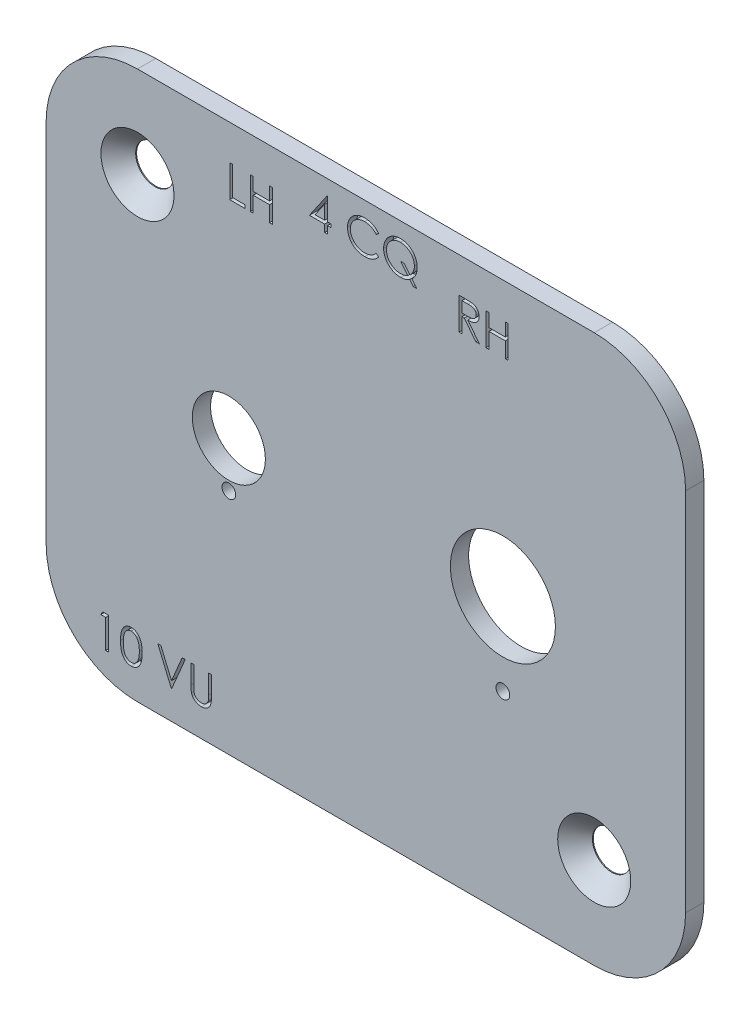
from build123d import *

# Parameters (mm, degrees)
ESQUISSE1_W             = 70
ESQUISSE1_H             = 60
BOSS_EXTRU_1_DEPTH      = 2
CONG_1_R                = 10
ESQUISSE2_R             = 2.1
ENL_V_MAT_EXTRU_1_DEPTH = 93.217135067
CHANFREIN1_SIZE         = 1.9
ENL_V_MAT_EXTRU_4_DEPTH = 1
ESQUISSE5_R             = 4
ESQUISSE5_R_2           = 5.75
ESQUISSE5_R_3           = 0.75
ENL_V_MAT_EXTRU_5_DEPTH = 93.217135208


with BuildPart() as part:
    # Esquisse1 → Boss.-Extru.1 (new body)
    with BuildSketch(Plane.XY):
        with Locations((35, 30)):
            Rectangle(ESQUISSE1_W, ESQUISSE1_H)
    extrude(amount=-BOSS_EXTRU_1_DEPTH)

    # Cong_1
    cong_1_edges = [part.edges().sort_by_distance(p)[0] for p in [
        (0, 60, -1),
        (70, 60, -1),
        (70, 0, -1),
        (0, 0, -1),
    ]]
    fillet(cong_1_edges, radius=CONG_1_R)

    # Esquisse2 → Enl_v. mat.-Extru.1 (cut, through all)
    with BuildSketch(Plane.XY):
        with Locations((10, 50)):
            Circle(ESQUISSE2_R)
        with Locations((60, 10)):
            Circle(ESQUISSE2_R)
    extrude(amount=-ENL_V_MAT_EXTRU_1_DEPTH, mode=Mode.SUBTRACT)

    # Chanfrein1
    chanfrein1_edges = [part.edges().sort_by_distance(p)[0] for p in [
        (7.9, 50, 0),
        (57.9, 10, 0),
    ]]
    chamfer(chanfrein1_edges, length=CHANFREIN1_SIZE)

    # Esquisse4 → Enl_v. mat.-Extru.4 (cut)
    # profile 1 of 11: a face of its own
    with BuildSketch(Plane.XY):
        Polygon((20.105667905, 56.15497233), (20.419770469, 56.15497233), (20.419770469, 53.013946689), (21.765924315, 53.013946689), (21.765924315, 52.65497233), (20.105667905, 52.65497233), align=None)
    # profile 2 of 11: a face of its own
    with BuildSketch(Plane.XY):
        Polygon((22.349257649, 56.15497233), (22.663360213, 56.15497233), (22.663360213, 54.719074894), (24.458232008, 54.719074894), (24.458232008, 56.15497233), (24.772334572, 56.15497233), (24.772334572, 52.65497233), (24.458232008, 52.65497233), (24.458232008, 54.360100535), (22.663360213, 54.360100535), (22.663360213, 52.65497233), (22.349257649, 52.65497233), align=None)
    # profile 3 of 11: a face of its own
    with BuildSketch(Plane.XY):
        with BuildLine():
            Line((45.197947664, 56.15497233), (45.898368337, 56.15497233))
            add(Edge.make_bspline(
                [(45.898368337, 56.15497233), (45.945109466, 56.154816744), (46.03485761, 56.154518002), (46.16343088, 56.152852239), (46.280257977, 56.148077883), (46.385277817, 56.1439693), (46.478488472, 56.136477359), (46.560175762, 56.129316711), (46.62996346, 56.119943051), (46.672209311, 56.111237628), (46.691337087, 56.107296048)],
                knots=[0, 0, 0, 0, 1.410062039, 2.707475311, 3.878576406, 4.937260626, 5.877586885, 6.699081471, 7.410979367, 8, 8, 8, 8], degree=3))
            add(Edge.make_bspline(
                [(46.691337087, 56.107296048), (46.716943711, 56.100969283), (46.767610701, 56.088450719), (46.840560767, 56.061991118), (46.910075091, 56.031371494), (46.975864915, 55.995407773), (47.037600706, 55.953832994), (47.095919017, 55.907364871), (47.15108448, 55.856257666), (47.200866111, 55.799222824), (47.247805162, 55.739386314), (47.287393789, 55.674682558), (47.321520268, 55.60702103), (47.348690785, 55.535713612), (47.370568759, 55.46145184), (47.385994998, 55.383563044), (47.395246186, 55.302402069), (47.396188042, 55.24704416), (47.396665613, 55.218974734)],
                knots=[0, 0, 0, 0, 1.027469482, 2.033020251, 3.019912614, 3.986113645, 4.951240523, 5.91722682, 6.890402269, 7.87763091, 8.8651537, 9.85103654, 10.82876324, 11.815024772, 12.821070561, 13.842952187, 14.906261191, 16, 16, 16, 16], degree=3))
            add(Edge.make_bspline(
                [(47.396665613, 55.218974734), (47.395196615, 55.172339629), (47.392330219, 55.081342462), (47.365605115, 54.94928158), (47.321828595, 54.826092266), (47.261505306, 54.711929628), (47.184685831, 54.609018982), (47.09236104, 54.518628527), (46.984479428, 54.442988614), (46.884050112, 54.39053581), (46.795335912, 54.356942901), (46.7223026, 54.333306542), (46.642635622, 54.315044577), (46.557098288, 54.298684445), (46.465334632, 54.286332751), (46.367564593, 54.277286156), (46.263718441, 54.271632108), (46.192379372, 54.270790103), (46.155680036, 54.270356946)],
                knots=[0, 0, 0, 0, 1.260483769, 2.459530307, 3.627416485, 4.787058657, 5.939039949, 7.08810263, 8.267026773, 9.491475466, 10.141966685, 10.831826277, 11.566392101, 12.351337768, 13.187381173, 14.07005841, 15.007169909, 16, 16, 16, 16], degree=3))
            Line((46.155680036, 54.270356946), (47.441537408, 52.65497233))
            Line((47.441537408, 52.65497233), (47.053115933, 52.65497233))
            Line((47.053115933, 52.65497233), (45.767258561, 54.270356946))
            Line((45.767258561, 54.270356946), (45.512050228, 54.270356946))
            Line((45.512050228, 54.270356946), (45.512050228, 52.65497233))
            Line((45.512050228, 52.65497233), (45.197947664, 52.65497233))
            Line((45.197947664, 52.65497233), (45.197947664, 56.15497233))
        make_face()
        with BuildLine():
            Line((45.512050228, 55.795997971), (45.512050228, 54.629331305))
            Line((45.512050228, 54.629331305), (46.152875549, 54.624423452))
            add(Edge.make_bspline(
                [(46.152875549, 54.624423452), (46.182795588, 54.624410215), (46.240789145, 54.624384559), (46.324689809, 54.628378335), (46.402809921, 54.632921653), (46.474850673, 54.639870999), (46.540844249, 54.648827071), (46.600757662, 54.660030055), (46.654688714, 54.673082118), (46.717587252, 54.693283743), (46.787823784, 54.725289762), (46.864155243, 54.77185526), (46.929157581, 54.83042438), (46.984075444, 54.897397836), (47.028204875, 54.971034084), (47.059316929, 55.050450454), (47.079059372, 55.133642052), (47.081387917, 55.190820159), (47.082563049, 55.219675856)],
                knots=[0, 0, 0, 0, 1.146690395, 2.22261258, 3.21895312, 4.145990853, 4.996080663, 5.770904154, 6.481378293, 7.121626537, 8.300444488, 9.431385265, 10.535395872, 11.636531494, 12.74115979, 13.810798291, 14.895190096, 16, 16, 16, 16], degree=3))
            add(Edge.make_bspline(
                [(47.082563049, 55.219675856), (47.081360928, 55.24782243), (47.078978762, 55.303598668), (47.059529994, 55.385254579), (47.026640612, 55.462321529), (46.982318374, 55.534486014), (46.928319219, 55.59999175), (46.865001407, 55.656038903), (46.794096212, 55.702288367), (46.727825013, 55.731842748), (46.668590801, 55.749962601), (46.617161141, 55.762713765), (46.559049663, 55.772958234), (46.493974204, 55.781166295), (46.422212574, 55.788221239), (46.343401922, 55.792973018), (46.258065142, 55.795786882), (46.198918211, 55.795925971), (46.168300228, 55.795997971)],
                knots=[0, 0, 0, 0, 1.101028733, 2.181837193, 3.264309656, 4.369019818, 5.486613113, 6.575447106, 7.666700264, 8.788928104, 9.402425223, 10.0903467, 10.862060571, 11.710948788, 12.657782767, 13.684531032, 14.801375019, 16, 16, 16, 16], degree=3))
            Line((46.168300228, 55.795997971), (45.512050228, 55.795997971))
        make_face(mode=Mode.SUBTRACT)
    # profile 4 of 11: a face of its own
    with BuildSketch(Plane.XY):
        Polygon((48.159486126, 56.15497233), (48.47358869, 56.15497233), (48.47358869, 54.719074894), (50.268460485, 54.719074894), (50.268460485, 56.15497233), (50.582563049, 56.15497233), (50.582563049, 52.65497233), (50.268460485, 52.65497233), (50.268460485, 54.360100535), (48.47358869, 54.360100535), (48.47358869, 52.65497233), (48.159486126, 52.65497233), align=None)
    # profile 5 of 11: a face of its own
    with BuildSketch(Plane.XY):
        Polygon((30.732146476, 58.322420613), (30.79594856, 58.322420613), (30.79594856, 55.89934369), (31.199794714, 55.89934369), (31.199794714, 55.540369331), (30.79594856, 55.540369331), (30.79594856, 54.732677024), (30.481845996, 54.732677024), (30.481845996, 55.540369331), (28.821589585, 55.540369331), align=None)
        Polygon((30.481845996, 55.89934369), (30.481845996, 57.419375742), (29.438576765, 55.89934369), align=None, mode=Mode.SUBTRACT)
    # profile 6 of 11: a face of its own
    with BuildSketch(Plane.XY):
        with BuildLine():
            Line((36.404922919, 57.59044946), (36.130083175, 57.380112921))
            add(Edge.make_bspline(
                [(36.130083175, 57.380112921), (36.110477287, 57.403478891), (36.07152984, 57.449895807), (36.008870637, 57.515075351), (35.943568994, 57.576140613), (35.875649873, 57.633382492), (35.803890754, 57.684799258), (35.730029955, 57.733070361), (35.65283191, 57.776338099), (35.546080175, 57.828801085), (35.406432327, 57.88354724), (35.230637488, 57.929450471), (35.047126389, 57.958671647), (34.92192879, 57.961836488), (34.858248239, 57.963446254)],
                knots=[0, 0, 0, 0, 0.757959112, 1.505699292, 2.245454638, 2.979532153, 3.711538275, 4.438200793, 5.171680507, 5.909471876, 7.393775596, 8.890124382, 10.418191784, 12, 12, 12, 12], degree=3))
            add(Edge.make_bspline(
                [(34.858248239, 57.963446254), (34.82316494, 57.963042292), (34.753323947, 57.962238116), (34.649675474, 57.951628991), (34.547962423, 57.936717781), (34.448250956, 57.914592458), (34.350667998, 57.886619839), (34.254575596, 57.853194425), (34.161364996, 57.811839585), (34.069746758, 57.766131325), (33.981967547, 57.71450388), (33.898912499, 57.658190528), (33.820884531, 57.597821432), (33.747821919, 57.533170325), (33.679649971, 57.464528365), (33.61686266, 57.391164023), (33.55967725, 57.31331185), (33.506960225, 57.231998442), (33.459747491, 57.147460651), (33.420217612, 57.05938558), (33.38521249, 56.969281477), (33.357513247, 56.876130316), (33.33558873, 56.78058755), (33.320461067, 56.682396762), (33.309972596, 56.581763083), (33.309172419, 56.51355377), (33.308769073, 56.479171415)],
                knots=[0, 0, 0, 0, 1.054917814, 2.100044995, 3.131103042, 4.146048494, 5.169673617, 6.183595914, 7.203665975, 8.234915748, 9.262203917, 10.264457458, 11.251630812, 12.227803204, 13.197192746, 14.159520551, 15.12972552, 16.100847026, 17.073214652, 18.039054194, 19.002613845, 19.979014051, 20.95965708, 21.949030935, 22.966165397, 24, 24, 24, 24], degree=3))
            add(Edge.make_bspline(
                [(33.308769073, 56.479171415), (33.310030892, 56.427440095), (33.312508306, 56.32587251), (33.33455664, 56.177101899), (33.368061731, 56.034581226), (33.418277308, 55.899201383), (33.480196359, 55.769293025), (33.55843697, 55.647054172), (33.649053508, 55.530637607), (33.753327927, 55.42279466), (33.867733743, 55.324280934), (33.990481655, 55.237530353), (34.121265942, 55.16521547), (34.258642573, 55.105039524), (34.403668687, 55.058782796), (34.556083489, 55.026218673), (34.715555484, 55.004976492), (34.824524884, 55.002942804), (34.879983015, 55.001907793)],
                knots=[0, 0, 0, 0, 1.029171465, 2.020641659, 2.987623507, 3.938342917, 4.889210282, 5.84687017, 6.821220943, 7.821438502, 8.827599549, 9.822697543, 10.807740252, 11.797342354, 12.80366471, 13.83203677, 14.896651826, 16, 16, 16, 16], degree=3))
            add(Edge.make_bspline(
                [(34.879983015, 55.001907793), (34.941085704, 55.003596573), (35.061350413, 55.006920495), (35.237718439, 55.035079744), (35.406554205, 55.080737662), (35.567866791, 55.144635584), (35.721201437, 55.227700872), (35.866798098, 55.32839875), (36.004779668, 55.447687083), (36.087750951, 55.538770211), (36.130083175, 55.585241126)],
                knots=[0, 0, 0, 0, 1.028121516, 2.023589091, 2.998037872, 3.967518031, 4.937445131, 5.927275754, 6.942489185, 8, 8, 8, 8], degree=3))
            Line((36.130083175, 55.585241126), (36.404922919, 55.377007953))
            add(Edge.make_bspline(
                [(36.404922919, 55.377007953), (36.382804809, 55.348469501), (36.338674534, 55.291529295), (36.267216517, 55.211257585), (36.191939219, 55.13575355), (36.112283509, 55.065625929), (36.029165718, 54.999471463), (35.941093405, 54.939169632), (35.849224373, 54.883878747), (35.753869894, 54.833251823), (35.655131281, 54.788334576), (35.553126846, 54.749880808), (35.448296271, 54.716755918), (35.340634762, 54.689503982), (35.229919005, 54.668232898), (35.116548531, 54.654013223), (35.000278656, 54.644271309), (34.921837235, 54.643383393), (34.88208638, 54.642933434)],
                knots=[0, 0, 0, 0, 0.986787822, 1.968848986, 2.935600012, 3.899624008, 4.868462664, 5.837806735, 6.815139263, 7.798259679, 8.787526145, 9.778297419, 10.776456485, 11.791383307, 12.812564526, 13.85620153, 14.913611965, 16, 16, 16, 16], degree=3))
            add(Edge.make_bspline(
                [(34.88208638, 54.642933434), (34.844442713, 54.643195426), (34.770007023, 54.643713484), (34.660108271, 54.652105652), (34.553118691, 54.663555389), (34.449344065, 54.68079552), (34.34821809, 54.70113986), (34.250657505, 54.728411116), (34.155702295, 54.758960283), (34.063733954, 54.79486527), (33.974674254, 54.835381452), (33.888810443, 54.881173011), (33.806182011, 54.931854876), (33.72597659, 54.986309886), (33.649379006, 55.046287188), (33.575725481, 55.110953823), (33.504603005, 55.180091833), (33.46060032, 55.229946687), (33.438476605, 55.255012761)],
                knots=[0, 0, 0, 0, 1.114604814, 2.203992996, 3.262667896, 4.300477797, 5.318619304, 6.316056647, 7.298880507, 8.271930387, 9.238335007, 10.195173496, 11.151986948, 12.108099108, 13.064862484, 14.031167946, 15.010108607, 16, 16, 16, 16], degree=3))
            add(Edge.make_bspline(
                [(33.438476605, 55.255012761), (33.403040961, 55.29855395), (33.332597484, 55.38511066), (33.242471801, 55.525396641), (33.165324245, 55.67186485), (33.102948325, 55.825284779), (33.054185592, 55.985312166), (33.020404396, 56.152027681), (32.998452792, 56.325275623), (32.995942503, 56.443112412), (32.994666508, 56.503009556)],
                knots=[0, 0, 0, 0, 0.994628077, 1.977248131, 2.950237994, 3.925870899, 4.908910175, 5.911660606, 6.938484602, 8, 8, 8, 8], degree=3))
            add(Edge.make_bspline(
                [(32.994666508, 56.503009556), (32.996221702, 56.565965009), (32.999281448, 56.689825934), (33.025277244, 56.871599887), (33.06709604, 57.045751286), (33.126492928, 57.211955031), (33.20179828, 57.371085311), (33.294824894, 57.521926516), (33.404492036, 57.665443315), (33.529939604, 57.799458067), (33.667506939, 57.921997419), (33.814825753, 58.029803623), (33.9716077, 58.119521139), (34.136125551, 58.194517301), (34.309611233, 58.252161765), (34.491694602, 58.292514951), (34.682033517, 58.317632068), (34.811895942, 58.320807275), (34.877879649, 58.322420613)],
                knots=[0, 0, 0, 0, 1.032925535, 2.032216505, 3.007276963, 3.968222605, 4.92396291, 5.891752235, 6.871517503, 7.883894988, 8.900124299, 9.891468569, 10.874487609, 11.85992873, 12.854644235, 13.869047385, 14.917252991, 16, 16, 16, 16], degree=3))
            add(Edge.make_bspline(
                [(34.877879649, 58.322420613), (34.918094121, 58.321938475), (34.997694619, 58.320984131), (35.115447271, 58.311677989), (35.230089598, 58.296164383), (35.34170058, 58.275048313), (35.450823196, 58.248840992), (35.556623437, 58.214700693), (35.659722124, 58.175664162), (35.759469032, 58.130705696), (35.855385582, 58.080238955), (35.947441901, 58.024823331), (36.03490676, 57.964527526), (36.118395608, 57.89986435), (36.196511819, 57.829465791), (36.271473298, 57.755268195), (36.340734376, 57.675134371), (36.383487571, 57.618729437), (36.404922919, 57.59044946)],
                knots=[0, 0, 0, 0, 1.096760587, 2.17092713, 3.219439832, 4.250915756, 5.268269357, 6.278326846, 7.281116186, 8.274029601, 9.260640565, 10.235837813, 11.203064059, 12.156899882, 13.114053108, 14.069676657, 15.032185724, 16, 16, 16, 16], degree=3))
        make_face()
    # profile 7 of 11: a face of its own
    with BuildSketch(Plane.XY):
        with BuildLine():
            Line((40.040239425, 55.122500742), (40.577999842, 54.463446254))
            Line((40.577999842, 54.463446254), (40.186072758, 54.463446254))
            Line((40.186072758, 54.463446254), (39.797651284, 54.938806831))
            add(Edge.make_bspline(
                [(39.797651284, 54.938806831), (39.758694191, 54.915133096), (39.681497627, 54.868221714), (39.561130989, 54.807755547), (39.438370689, 54.757439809), (39.313488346, 54.715869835), (39.186665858, 54.68259551), (39.057260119, 54.659501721), (38.925740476, 54.646091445), (38.837378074, 54.643990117), (38.792943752, 54.642933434)],
                knots=[0, 0, 0, 0, 1.030216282, 2.041455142, 3.041201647, 4.026904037, 5.014869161, 6.002481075, 6.995518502, 8, 8, 8, 8], degree=3))
            add(Edge.make_bspline(
                [(38.792943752, 54.642933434), (38.729283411, 54.64446678), (38.604018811, 54.64748395), (38.420048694, 54.673824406), (38.243465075, 54.714504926), (38.074619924, 54.77336559), (37.913329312, 54.848548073), (37.759668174, 54.941237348), (37.613558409, 55.050149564), (37.477156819, 55.174572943), (37.352431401, 55.309928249), (37.242992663, 55.454549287), (37.149940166, 55.606036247), (37.07470168, 55.765144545), (37.014989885, 55.930489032), (36.974297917, 56.103444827), (36.947958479, 56.282982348), (36.944924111, 56.405225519), (36.943384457, 56.467252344)],
                knots=[0, 0, 0, 0, 1.055750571, 2.07740284, 3.077223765, 4.05828044, 5.038417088, 6.02463293, 7.030503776, 8.057169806, 9.083586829, 10.080154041, 11.061747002, 12.027853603, 12.995569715, 13.972756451, 14.971366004, 16, 16, 16, 16], degree=3))
            add(Edge.make_bspline(
                [(36.943384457, 56.467252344), (36.94393225, 56.508883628), (36.945023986, 56.5918537), (36.957653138, 56.714740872), (36.976416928, 56.835605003), (37.002957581, 56.95394383), (37.03770151, 57.070242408), (37.079355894, 57.184271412), (37.129825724, 57.295737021), (37.186880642, 57.404411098), (37.250513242, 57.509351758), (37.319829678, 57.609065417), (37.395000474, 57.70256939), (37.475972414, 57.789820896), (37.562422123, 57.871012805), (37.653606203, 57.947482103), (37.75146888, 58.016384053), (37.853427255, 58.080460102), (37.960053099, 58.136806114), (38.069260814, 58.187177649), (38.181867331, 58.228047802), (38.296411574, 58.262874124), (38.413588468, 58.289462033), (38.533306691, 58.308088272), (38.65548202, 58.320839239), (38.737989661, 58.32189027), (38.779622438, 58.322420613)],
                knots=[0, 0, 0, 0, 1.030721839, 2.054201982, 3.056261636, 4.058906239, 5.055198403, 6.060579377, 7.06322398, 8.083343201, 9.098870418, 10.10084648, 11.0888991, 12.067804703, 13.046436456, 14.024708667, 15.012489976, 16.008294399, 17.005242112, 17.997338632, 18.984424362, 19.969624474, 20.960977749, 21.957320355, 22.969278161, 24, 24, 24, 24], degree=3))
            add(Edge.make_bspline(
                [(38.779622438, 58.322420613), (38.843283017, 58.320894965), (38.968316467, 58.317898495), (39.151830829, 58.291554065), (39.327894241, 58.250710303), (39.496381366, 58.192149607), (39.657141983, 58.116777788), (39.810108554, 58.024107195), (39.955518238, 57.915187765), (40.091207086, 57.790756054), (40.215638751, 57.655067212), (40.324558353, 57.509657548), (40.417228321, 57.356690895), (40.492602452, 57.195930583), (40.551154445, 57.027442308), (40.592083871, 56.851157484), (40.618302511, 56.667390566), (40.621332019, 56.542129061), (40.622871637, 56.478470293)],
                knots=[0, 0, 0, 0, 1.050672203, 2.063587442, 3.054842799, 4.031180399, 5.003107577, 5.981273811, 6.979214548, 7.998088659, 9.016962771, 10.014903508, 10.993069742, 11.96499692, 12.941334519, 13.932589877, 14.949327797, 16, 16, 16, 16], degree=3))
            add(Edge.make_bspline(
                [(40.622871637, 56.478470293), (40.621189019, 56.412232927), (40.617880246, 56.281980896), (40.589722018, 56.090980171), (40.544448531, 55.908529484), (40.480245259, 55.734748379), (40.397244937, 55.569668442), (40.297051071, 55.411638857), (40.178457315, 55.260670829), (40.08679726, 55.169042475), (40.040239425, 55.122500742)],
                knots=[0, 0, 0, 0, 1.045660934, 2.056233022, 3.041853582, 4.009978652, 4.97562384, 5.954545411, 6.961031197, 8, 8, 8, 8], degree=3))
        make_face()
        with BuildLine():
            add(Edge.make_bspline(
                [(39.829201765, 55.381214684), (39.867390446, 55.419997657), (39.942509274, 55.496285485), (40.039974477, 55.621393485), (40.123804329, 55.751440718), (40.190919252, 55.888157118), (40.244318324, 56.02982983), (40.281211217, 56.177581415), (40.304311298, 56.330739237), (40.307272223, 56.434918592), (40.308769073, 56.487584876)],
                knots=[0, 0, 0, 0, 1.052210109, 2.069743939, 3.061837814, 4.040478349, 5.010453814, 5.985306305, 6.981502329, 8, 8, 8, 8], degree=3))
            add(Edge.make_bspline(
                [(40.308769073, 56.487584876), (40.308377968, 56.521501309), (40.307604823, 56.588548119), (40.296974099, 56.687765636), (40.281934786, 56.784791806), (40.26016247, 56.879453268), (40.232125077, 56.971558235), (40.197496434, 57.060981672), (40.156951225, 57.148012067), (40.10968437, 57.232108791), (40.057576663, 57.313149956), (39.999574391, 57.390144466), (39.936493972, 57.462695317), (39.869024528, 57.531998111), (39.79586525, 57.596624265), (39.717278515, 57.656546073), (39.63423269, 57.713213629), (39.546316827, 57.764363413), (39.455719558, 57.811387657), (39.362971, 57.852107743), (39.268849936, 57.886596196), (39.173502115, 57.914561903), (39.07705092, 57.936574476), (38.979327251, 57.951596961), (38.880583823, 57.962216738), (38.814239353, 57.963036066), (38.781024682, 57.963446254)],
                knots=[0, 0, 0, 0, 1.032958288, 2.041976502, 3.037103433, 4.023477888, 4.998866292, 5.968231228, 6.943073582, 7.921783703, 8.90545537, 9.876780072, 10.85618943, 11.833110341, 12.821898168, 13.827467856, 14.842673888, 15.88323808, 16.924703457, 17.951432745, 18.967462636, 19.976958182, 20.977218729, 21.979378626, 22.98839684, 24, 24, 24, 24], degree=3))
            add(Edge.make_bspline(
                [(38.781024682, 57.963446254), (38.74757692, 57.963033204), (38.680767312, 57.962208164), (38.581547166, 57.951655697), (38.483599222, 57.936557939), (38.387354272, 57.914654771), (38.292471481, 57.886634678), (38.199245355, 57.851937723), (38.106865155, 57.812223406), (38.017247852, 57.765229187), (37.930550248, 57.713639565), (37.84809534, 57.65753547), (37.771013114, 57.59635715), (37.698572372, 57.531089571), (37.630954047, 57.461229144), (37.567838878, 57.387240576), (37.510335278, 57.308265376), (37.457651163, 57.225716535), (37.411086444, 57.139504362), (37.369090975, 57.051184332), (37.334981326, 56.959782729), (37.306978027, 56.866031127), (37.284095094, 56.770162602), (37.269346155, 56.671620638), (37.258635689, 56.571020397), (37.257872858, 56.503039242), (37.257487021, 56.468654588)],
                knots=[0, 0, 0, 0, 1.013205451, 2.023808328, 3.020541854, 4.015386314, 5.012622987, 6.016502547, 7.02834558, 8.057881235, 9.080621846, 10.084476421, 11.077781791, 12.060654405, 13.037357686, 14.022218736, 15.005346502, 15.995617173, 16.98763393, 17.973029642, 18.956998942, 19.940662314, 20.93709383, 21.940823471, 22.958474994, 24, 24, 24, 24], degree=3))
            add(Edge.make_bspline(
                [(37.257487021, 56.468654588), (37.258800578, 56.418101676), (37.26138475, 56.318648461), (37.282806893, 56.172633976), (37.318723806, 56.032847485), (37.368973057, 55.899089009), (37.4320541, 55.770587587), (37.510500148, 55.648602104), (37.603976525, 55.533597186), (37.708946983, 55.424782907), (37.824416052, 55.326201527), (37.946824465, 55.239439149), (38.075127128, 55.165828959), (38.209726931, 55.106416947), (38.349620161, 55.058707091), (38.495911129, 55.026406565), (38.647643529, 55.004996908), (38.751034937, 55.002947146), (38.803460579, 55.001907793)],
                knots=[0, 0, 0, 0, 1.022526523, 2.011626, 2.97850031, 3.937665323, 4.897797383, 5.869804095, 6.865337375, 7.89202157, 8.925035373, 9.93268082, 10.923937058, 11.912550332, 12.905497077, 13.90928476, 14.939882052, 16, 16, 16, 16], degree=3))
            add(Edge.make_bspline(
                [(38.803460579, 55.001907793), (38.839478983, 55.002300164), (38.910720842, 55.003076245), (39.015774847, 55.013656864), (39.118258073, 55.028549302), (39.217221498, 55.051199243), (39.31352329, 55.0793581), (39.40659023, 55.113610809), (39.496916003, 55.154217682), (39.554349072, 55.186342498), (39.583108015, 55.202428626)],
                knots=[0, 0, 0, 0, 1.060694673, 2.097979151, 3.107774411, 4.11000626, 5.086069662, 6.061987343, 7.029562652, 8, 8, 8, 8], degree=3))
            Line((39.583108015, 55.202428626), (38.795047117, 56.16857446))
            Line((38.795047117, 56.16857446), (39.186974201, 56.16857446))
            Line((39.186974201, 56.16857446), (39.829201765, 55.381214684))
        make_face(mode=Mode.SUBTRACT)
    # profile 8 of 11: a face of its own
    with BuildSketch(Plane.XY):
        Polygon((6.189703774, 6.630483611), (6.836839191, 6.630483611), (6.836839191, 3.130483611), (6.522736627, 3.130483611), (6.522736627, 6.271509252), (5.984275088, 6.271509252), align=None)
    # profile 9 of 11: a face of its own
    with BuildSketch(Plane.XY):
        with BuildLine():
            add(Edge.make_bspline(
                [(8.138121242, 4.879081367), (8.13844926, 4.935178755), (8.13908644, 5.044148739), (8.146174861, 5.202933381), (8.157950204, 5.35189367), (8.174087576, 5.491036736), (8.193725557, 5.620398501), (8.219941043, 5.739633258), (8.249753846, 5.849292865), (8.284306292, 5.949734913), (8.323294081, 6.042312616), (8.365728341, 6.128737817), (8.413293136, 6.20887975), (8.463270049, 6.28401754), (8.51768212, 6.352921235), (8.574980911, 6.416563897), (8.637402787, 6.473474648), (8.702825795, 6.52532095), (8.77184226, 6.570770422), (8.842484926, 6.610803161), (8.915240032, 6.645003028), (8.990306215, 6.671893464), (9.067008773, 6.69410431), (9.145615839, 6.709293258), (9.226257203, 6.718850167), (9.280688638, 6.719763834), (9.308293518, 6.720227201)],
                knots=[0, 0, 0, 0, 1.646270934, 3.197905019, 4.663502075, 6.030701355, 7.308322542, 8.50163776, 9.611534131, 10.641858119, 11.616356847, 12.558055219, 13.465016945, 14.349605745, 15.204443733, 16.039544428, 16.859896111, 17.680448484, 18.487036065, 19.28249412, 20.06191084, 20.843045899, 21.620316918, 22.403196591, 23.190181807, 24, 24, 24, 24], degree=3))
            add(Edge.make_bspline(
                [(9.308293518, 6.720227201), (9.336128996, 6.719739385), (9.391485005, 6.718769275), (9.47332538, 6.709445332), (9.553275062, 6.693974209), (9.630993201, 6.672053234), (9.707118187, 6.644857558), (9.781054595, 6.610770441), (9.853261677, 6.571091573), (9.922591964, 6.524467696), (9.98980658, 6.47248542), (10.053254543, 6.413722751), (10.112941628, 6.348773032), (10.169616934, 6.278331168), (10.221672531, 6.201046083), (10.271245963, 6.118261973), (10.315617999, 6.028531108), (10.358352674, 5.93335064), (10.395239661, 5.830086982), (10.428505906, 5.719322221), (10.455384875, 5.599748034), (10.477774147, 5.471991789), (10.495119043, 5.335584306), (10.507751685, 5.19081799), (10.51442477, 5.0375976), (10.515681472, 4.93283975), (10.51632637, 4.879081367)],
                knots=[0, 0, 0, 0, 0.810914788, 1.612654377, 2.396697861, 3.181598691, 3.963628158, 4.749916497, 5.551656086, 6.361998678, 7.18212741, 8.025565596, 8.878627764, 9.750805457, 10.657531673, 11.591944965, 12.560506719, 13.57287815, 14.630710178, 15.753379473, 16.941251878, 18.199788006, 19.531962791, 20.947069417, 22.433333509, 24, 24, 24, 24], degree=3))
            add(Edge.make_bspline(
                [(10.51632637, 4.879081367), (10.515674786, 4.825557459), (10.5144052, 4.721268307), (10.507826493, 4.568737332), (10.494867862, 4.424739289), (10.478657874, 4.288928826), (10.456206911, 4.161871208), (10.428601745, 4.043126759), (10.397951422, 3.932182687), (10.360116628, 3.829947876), (10.318705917, 3.734996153), (10.273650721, 3.646329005), (10.225380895, 3.563162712), (10.17279215, 3.486162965), (10.116738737, 3.414784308), (10.056020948, 3.350286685), (9.992350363, 3.291116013), (9.924937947, 3.238464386), (9.854526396, 3.192379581), (9.782567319, 3.151165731), (9.707783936, 3.117933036), (9.631870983, 3.089397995), (9.553742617, 3.067597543), (9.473496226, 3.052523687), (9.39153999, 3.041951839), (9.336138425, 3.041145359), (9.308293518, 3.040740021)],
                knots=[0, 0, 0, 0, 1.561518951, 3.042555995, 4.452378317, 5.7783523, 7.031515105, 8.214008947, 9.334062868, 10.386615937, 11.391082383, 12.354592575, 13.286541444, 14.194233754, 15.072674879, 15.931287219, 16.775624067, 17.606195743, 18.42308326, 19.229000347, 20.022332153, 20.807536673, 21.593273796, 22.3848459, 23.188221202, 24, 24, 24, 24], degree=3))
            add(Edge.make_bspline(
                [(9.308293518, 3.040740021), (9.280689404, 3.041206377), (9.226259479, 3.042125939), (9.145607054, 3.05163967), (9.06732461, 3.066935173), (8.991025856, 3.088351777), (8.916319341, 3.114566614), (8.844223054, 3.148720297), (8.773935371, 3.188054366), (8.705643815, 3.232849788), (8.640631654, 3.284171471), (8.578533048, 3.340935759), (8.520908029, 3.404559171), (8.467273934, 3.474037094), (8.416299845, 3.548730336), (8.369410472, 3.629658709), (8.326039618, 3.71650132), (8.286396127, 3.80981923), (8.251247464, 3.910974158), (8.220199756, 4.021123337), (8.195685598, 4.141238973), (8.174702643, 4.27035634), (8.15777826, 4.40903027), (8.146223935, 4.557336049), (8.13908262, 4.715181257), (8.138447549, 4.823451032), (8.138121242, 4.879081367)],
                knots=[0, 0, 0, 0, 0.810891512, 1.598919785, 2.382837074, 3.152667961, 3.926044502, 4.706494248, 5.493654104, 6.291793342, 7.103789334, 7.925228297, 8.761435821, 9.622817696, 10.50288917, 11.416980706, 12.369136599, 13.353924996, 14.394355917, 15.514179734, 16.714354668, 17.994756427, 19.357759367, 20.818452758, 22.365282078, 24, 24, 24, 24], degree=3))
        make_face()
        with BuildLine():
            add(Edge.make_bspline(
                [(8.452223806, 4.880483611), (8.452343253, 4.833734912), (8.452575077, 4.743004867), (8.458631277, 4.611161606), (8.466881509, 4.488191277), (8.477522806, 4.373937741), (8.493325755, 4.268787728), (8.511032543, 4.172018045), (8.532580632, 4.084140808), (8.55807565, 4.004552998), (8.587114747, 3.931903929), (8.618820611, 3.864302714), (8.652881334, 3.800950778), (8.691000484, 3.742417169), (8.732515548, 3.688511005), (8.776488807, 3.638278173), (8.824561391, 3.593481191), (8.891065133, 3.539754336), (8.978861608, 3.484235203), (9.089482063, 3.435889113), (9.203150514, 3.405506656), (9.280301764, 3.4016429), (9.318810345, 3.39971438)],
                knots=[0, 0, 0, 0, 1.459021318, 2.831673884, 4.118529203, 5.306027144, 6.411944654, 7.436330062, 8.375795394, 9.233974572, 10.042671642, 10.816086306, 11.563610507, 12.285937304, 12.993564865, 13.685989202, 14.367179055, 15.041617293, 16.353048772, 17.594441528, 18.799311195, 20, 20, 20, 20], degree=3))
            add(Edge.make_bspline(
                [(9.318810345, 3.39971438), (9.357568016, 3.401312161), (9.43500334, 3.404504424), (9.548137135, 3.435303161), (9.657967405, 3.481772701), (9.744039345, 3.536720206), (9.809521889, 3.589048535), (9.856438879, 3.633663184), (9.899500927, 3.683619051), (9.940343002, 3.737518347), (9.977802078, 3.796390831), (10.011865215, 3.859953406), (10.042948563, 3.928382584), (10.060657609, 3.976152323), (10.069711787, 4.000575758)],
                knots=[0, 0, 0, 0, 1.353760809, 2.704726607, 4.075137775, 5.516104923, 6.260822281, 7.007110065, 7.778089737, 8.566572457, 9.372053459, 10.217411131, 11.088608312, 12, 12, 12, 12], degree=3))
            add(Edge.make_bspline(
                [(10.069711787, 4.000575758), (10.080263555, 4.031805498), (10.101688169, 4.095215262), (10.129299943, 4.193578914), (10.151045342, 4.296781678), (10.170608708, 4.404206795), (10.183961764, 4.516646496), (10.194709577, 4.63375288), (10.201040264, 4.755614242), (10.201825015, 4.838409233), (10.202223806, 4.880483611)],
                knots=[0, 0, 0, 0, 0.884706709, 1.796334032, 2.740027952, 3.714592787, 4.726048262, 5.777819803, 6.87074269, 8, 8, 8, 8], degree=3))
            add(Edge.make_bspline(
                [(10.202223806, 4.880483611), (10.201673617, 4.922551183), (10.200597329, 5.004844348), (10.196483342, 5.125362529), (10.185859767, 5.23983029), (10.174060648, 5.348740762), (10.156663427, 5.451491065), (10.13790562, 5.54894137), (10.112704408, 5.639884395), (10.085784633, 5.725743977), (10.054974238, 5.805544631), (10.021058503, 5.879658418), (9.984836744, 5.948443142), (9.945494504, 6.011710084), (9.903498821, 6.069742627), (9.857741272, 6.121377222), (9.810036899, 6.16821419), (9.743219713, 6.221676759), (9.655745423, 6.276188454), (9.546899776, 6.326354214), (9.433629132, 6.355162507), (9.357055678, 6.359224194), (9.318810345, 6.361252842)],
                knots=[0, 0, 0, 0, 1.31362396, 2.569729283, 3.763502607, 4.902122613, 5.988968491, 7.01645872, 7.998833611, 8.933434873, 9.825090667, 10.667526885, 11.477055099, 12.250526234, 12.991942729, 13.710640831, 14.402115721, 15.076753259, 16.378508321, 17.609869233, 18.806226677, 20, 20, 20, 20], degree=3))
            add(Edge.make_bspline(
                [(9.318810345, 6.361252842), (9.280099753, 6.359221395), (9.202608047, 6.355154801), (9.088160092, 6.326461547), (8.978455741, 6.276448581), (8.891212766, 6.221496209), (8.82434898, 6.169157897), (8.777266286, 6.123771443), (8.733120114, 6.074125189), (8.692452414, 6.019723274), (8.654363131, 5.961257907), (8.619382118, 5.898269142), (8.587864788, 5.830437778), (8.558780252, 5.757821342), (8.533207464, 5.678240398), (8.512113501, 5.590471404), (8.492626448, 5.494009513), (8.478831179, 5.388290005), (8.466567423, 5.274007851), (8.458686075, 5.150730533), (8.452554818, 5.018666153), (8.452336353, 4.927466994), (8.452223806, 4.880483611)],
                knots=[0, 0, 0, 0, 1.207732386, 2.417664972, 3.655092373, 4.956220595, 5.625982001, 6.301752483, 6.994047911, 7.697131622, 8.419323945, 9.170223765, 9.943494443, 10.752040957, 11.610060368, 12.549350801, 13.567764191, 14.679664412, 15.874934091, 17.154273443, 18.533957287, 20, 20, 20, 20], degree=3))
        make_face(mode=Mode.SUBTRACT)
    # profile 10 of 11: a face of its own
    with BuildSketch(Plane.XY):
        Polygon((12.221454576, 6.630483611), (12.557993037, 6.630483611), (13.724659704, 3.87227047), (14.89132637, 6.630483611), (15.227864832, 6.630483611), (13.747095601, 3.130483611), (13.702223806, 3.130483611), align=None)
    # profile 11 of 11: a face of its own
    with BuildSketch(Plane.XY):
        with BuildLine():
            Line((15.85606996, 6.630483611), (16.170172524, 6.630483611))
            Line((16.170172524, 6.630483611), (16.170172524, 4.533428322))
            add(Edge.make_bspline(
                [(16.170172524, 4.533428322), (16.17012578, 4.503747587), (16.170037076, 4.447423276), (16.170629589, 4.367254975), (16.172288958, 4.295982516), (16.173335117, 4.233331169), (16.175662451, 4.179588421), (16.177560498, 4.13446311), (16.180001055, 4.098168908), (16.182934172, 4.076987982), (16.18419496, 4.067883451)],
                knots=[0, 0, 0, 0, 1.528628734, 2.90083645, 4.128790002, 5.200304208, 6.127813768, 6.898992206, 7.526736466, 8, 8, 8, 8], degree=3))
            add(Edge.make_bspline(
                [(16.18419496, 4.067883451), (16.189372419, 4.035036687), (16.199435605, 3.971193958), (16.225081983, 3.880285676), (16.260899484, 3.798354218), (16.303342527, 3.722842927), (16.359275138, 3.655853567), (16.426278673, 3.594141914), (16.507456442, 3.540170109), (16.597717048, 3.490819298), (16.695002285, 3.451154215), (16.794413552, 3.421160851), (16.894456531, 3.402881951), (16.961432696, 3.400765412), (16.994691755, 3.39971438)],
                knots=[0, 0, 0, 0, 1.035780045, 2.013197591, 2.933192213, 3.817615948, 4.702609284, 5.640816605, 6.646850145, 7.73207398, 8.84249596, 9.914020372, 10.964143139, 12, 12, 12, 12], degree=3))
            add(Edge.make_bspline(
                [(16.994691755, 3.39971438), (17.023245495, 3.40078823), (17.080188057, 3.402929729), (17.164794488, 3.41619116), (17.247194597, 3.440091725), (17.327795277, 3.470931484), (17.403346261, 3.511679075), (17.473889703, 3.558749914), (17.536853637, 3.61396079), (17.594311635, 3.675061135), (17.644346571, 3.744000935), (17.687717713, 3.819279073), (17.723243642, 3.90202842), (17.740787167, 3.960182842), (17.749799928, 3.990058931)],
                knots=[0, 0, 0, 0, 0.994687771, 1.983630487, 2.973142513, 3.978332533, 4.983357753, 5.956394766, 6.925816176, 7.893390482, 8.871859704, 9.88551698, 10.913711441, 12, 12, 12, 12], degree=3))
            add(Edge.make_bspline(
                [(17.749799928, 3.990058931), (17.752800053, 4.002407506), (17.759485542, 4.029925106), (17.765732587, 4.076446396), (17.772239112, 4.13133576), (17.776753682, 4.194987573), (17.781154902, 4.267188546), (17.783787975, 4.348314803), (17.785005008, 4.438071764), (17.785367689, 4.500708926), (17.78555714, 4.533428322)],
                knots=[0, 0, 0, 0, 0.558680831, 1.244966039, 2.062412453, 2.990489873, 4.051219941, 5.244515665, 6.560634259, 8, 8, 8, 8], degree=3))
            Line((17.78555714, 4.533428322), (17.78555714, 6.630483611))
            Line((17.78555714, 6.630483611), (18.099659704, 6.630483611))
            Line((18.099659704, 6.630483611), (18.099659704, 4.516601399))
            add(Edge.make_bspline(
                [(18.099659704, 4.516601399), (18.099405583, 4.47850302), (18.098909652, 4.404151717), (18.094609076, 4.295200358), (18.087752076, 4.191847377), (18.078063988, 4.094078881), (18.065226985, 4.002244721), (18.050951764, 3.915539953), (18.032772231, 3.834586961), (18.01153883, 3.758754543), (17.987265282, 3.686569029), (17.955824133, 3.618060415), (17.920399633, 3.551146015), (17.878384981, 3.486837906), (17.831173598, 3.424851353), (17.777721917, 3.365562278), (17.719797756, 3.308023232), (17.656438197, 3.253710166), (17.588687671, 3.203901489), (17.516747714, 3.160103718), (17.441170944, 3.1230801), (17.362153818, 3.092604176), (17.279662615, 3.069689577), (17.193695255, 3.052614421), (17.104056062, 3.042912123), (17.043091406, 3.041470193), (17.0122198, 3.040740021)],
                knots=[0, 0, 0, 0, 1.316592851, 2.569410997, 3.76748051, 4.895814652, 5.963796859, 6.97159953, 7.931736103, 8.829262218, 9.692595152, 10.560224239, 11.431080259, 12.30701507, 13.211635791, 14.121146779, 15.063487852, 16.031507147, 17.00238618, 17.966455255, 18.938106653, 19.907068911, 20.888905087, 21.893141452, 22.933117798, 24, 24, 24, 24], degree=3))
            add(Edge.make_bspline(
                [(17.0122198, 3.040740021), (16.978550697, 3.041524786), (16.912492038, 3.043064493), (16.815153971, 3.051887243), (16.721839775, 3.068505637), (16.631563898, 3.089665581), (16.545555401, 3.118849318), (16.462661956, 3.152947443), (16.384303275, 3.194824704), (16.309208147, 3.241418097), (16.23938339, 3.293842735), (16.175285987, 3.350982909), (16.116810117, 3.411923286), (16.06494142, 3.477323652), (16.018820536, 3.546675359), (15.979090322, 3.620174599), (15.944977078, 3.697792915), (15.927370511, 3.751746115), (15.9184698, 3.779021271)],
                knots=[0, 0, 0, 0, 1.13879206, 2.234305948, 3.301075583, 4.341971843, 5.366689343, 6.369221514, 7.369726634, 8.367512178, 9.355451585, 10.318319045, 11.268648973, 12.207971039, 13.137398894, 14.081662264, 15.030215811, 16, 16, 16, 16], degree=3))
            add(Edge.make_bspline(
                [(15.9184698, 3.779021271), (15.913292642, 3.797653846), (15.90206327, 3.838068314), (15.890037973, 3.904954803), (15.879928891, 3.981969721), (15.870423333, 4.069118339), (15.864814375, 4.166468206), (15.859896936, 4.273977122), (15.856035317, 4.391775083), (15.85605809, 4.473829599), (15.85606996, 4.516601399)],
                knots=[0, 0, 0, 0, 0.625038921, 1.35572334, 2.194682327, 3.136881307, 4.189498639, 5.346923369, 6.617055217, 8, 8, 8, 8], degree=3))
            Line((15.85606996, 4.516601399), (15.85606996, 6.630483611))
        make_face()
    extrude(amount=-ENL_V_MAT_EXTRU_4_DEPTH, mode=Mode.SUBTRACT)

    # Esquisse5 → Enl_v. mat.-Extru.5 (cut, through all)
    with BuildSketch(Plane.XY):
        with Locations((20, 30)):
            Circle(ESQUISSE5_R)
        with Locations((50, 30)):
            Circle(ESQUISSE5_R_2)
        with Locations((20, 25)):
            Circle(ESQUISSE5_R_3)
        with Locations((50, 21)):
            Circle(ESQUISSE5_R_3)
    extrude(amount=-ENL_V_MAT_EXTRU_5_DEPTH, mode=Mode.SUBTRACT)


solid = part.part
